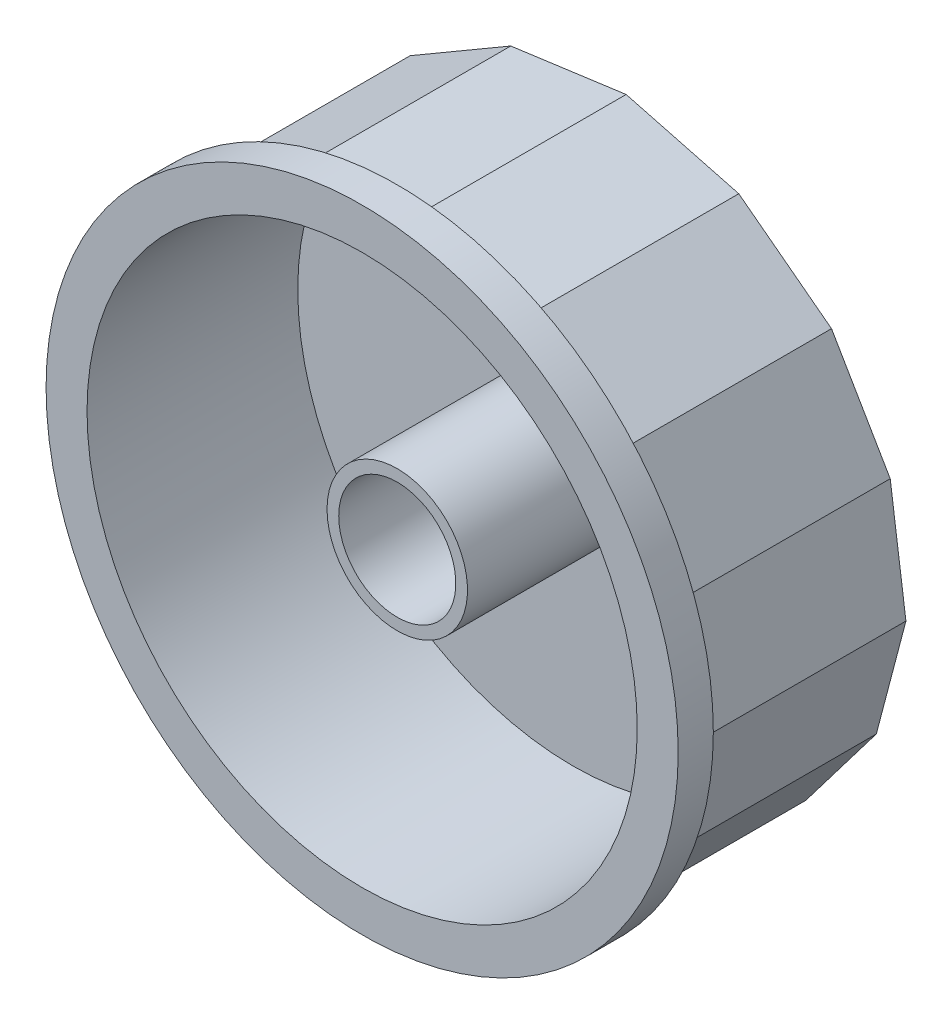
ISO-10303-21;
HEADER;
FILE_DESCRIPTION(('STEP AP214'),'2;1');
FILE_NAME('part.step','',(''),(''),'','','');
FILE_SCHEMA(('AUTOMOTIVE_DESIGN { 1 0 10303 214 1 1 1 1 }'));
ENDSEC;
DATA;
#1=APPLICATION_CONTEXT('core data for automotive mechanical design processes');
#2=APPLICATION_PROTOCOL_DEFINITION('international standard','automotive_design',2000,#1);
#3=PRODUCT_CONTEXT('',#1,'mechanical');
#4=PRODUCT('Part','Part','',(#3));
#5=PRODUCT_RELATED_PRODUCT_CATEGORY('part','',(#4));
#6=PRODUCT_DEFINITION_FORMATION('','',#4);
#7=PRODUCT_DEFINITION_CONTEXT('part definition',#1,'design');
#8=PRODUCT_DEFINITION('design','',#6,#7);
#9=PRODUCT_DEFINITION_SHAPE('','',#8);
#10=(LENGTH_UNIT() NAMED_UNIT(*) SI_UNIT(.MILLI.,.METRE.));
#11=(NAMED_UNIT(*) PLANE_ANGLE_UNIT() SI_UNIT($,.RADIAN.));
#12=(NAMED_UNIT(*) SI_UNIT($,.STERADIAN.) SOLID_ANGLE_UNIT());
#13=UNCERTAINTY_MEASURE_WITH_UNIT(LENGTH_MEASURE(1.E-05),#10,'distance_accuracy_value','');
#14=(GEOMETRIC_REPRESENTATION_CONTEXT(3) GLOBAL_UNCERTAINTY_ASSIGNED_CONTEXT((#13)) GLOBAL_UNIT_ASSIGNED_CONTEXT((#10,
#11,#12)) REPRESENTATION_CONTEXT('',''));
#15=CARTESIAN_POINT('',(0.,0.,0.));
#16=DIRECTION('',(0.,0.,1.));
#17=DIRECTION('',(1.,0.,0.));
#18=AXIS2_PLACEMENT_3D('',#15,#16,#17);
#19=CARTESIAN_POINT('',(0.,0.,0.));
#20=DIRECTION('',(0.,0.,1.));
#21=DIRECTION('',(1.,0.,0.));
#22=AXIS2_PLACEMENT_3D('',#19,#20,#21);
#23=PLANE('',#22);
#24=CARTESIAN_POINT('',(0.,0.,0.));
#25=DIRECTION('',(0.,0.,-1.));
#26=DIRECTION('',(-1.,0.,0.));
#27=AXIS2_PLACEMENT_3D('',#24,#25,#26);
#28=CIRCLE('',#27,11.);
#29=CARTESIAN_POINT('',(-11.,0.,0.));
#30=VERTEX_POINT('',#29);
#31=EDGE_CURVE('E287',#30,#30,#28,.T.);
#32=ORIENTED_EDGE('',*,*,#31,.F.);
#33=EDGE_LOOP('',(#32));
#34=FACE_BOUND('',#33,.T.);
#35=DIRECTION('',(0.13501757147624,-0.990843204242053,0.));
#36=VECTOR('',#35,1.);
#37=CARTESIAN_POINT('',(24.7810129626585,3.37679279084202,0.));
#38=LINE('',#37,#36);
#39=CARTESIAN_POINT('',(24.1093271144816,8.30604274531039,0.));
#40=VERTEX_POINT('',#39);
#41=CARTESIAN_POINT('',(25.4526988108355,-1.55245716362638,0.));
#42=VERTEX_POINT('',#41);
#43=EDGE_CURVE('E189',#40,#42,#38,.T.);
#44=ORIENTED_EDGE('',*,*,#43,.T.);
#45=DIRECTION('',(-0.254439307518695,-0.967088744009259,0.));
#46=VECTOR('',#45,1.);
#47=CARTESIAN_POINT('',(24.1869133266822,-6.36353335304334,0.));
#48=LINE('',#47,#46);
#49=CARTESIAN_POINT('',(22.9211278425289,-11.1746095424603,0.));
#50=VERTEX_POINT('',#49);
#51=EDGE_CURVE('E291',#42,#50,#48,.T.);
#52=ORIENTED_EDGE('',*,*,#51,.T.);
#53=DIRECTION('',(-0.605160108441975,-0.796103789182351,0.));
#54=VECTOR('',#53,1.);
#55=CARTESIAN_POINT('',(19.9105753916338,-15.1350692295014,0.));
#56=LINE('',#55,#54);
#57=CARTESIAN_POINT('',(16.9000229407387,-19.0955289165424,0.));
#58=VERTEX_POINT('',#57);
#59=EDGE_CURVE('E208',#50,#58,#56,.T.);
#60=ORIENTED_EDGE('',*,*,#59,.T.);
#61=DIRECTION('',(-0.863750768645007,-0.50391924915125,0.));
#62=VECTOR('',#61,1.);
#63=CARTESIAN_POINT('',(12.6030328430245,-21.602428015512,0.));
#64=LINE('',#63,#62);
#65=CARTESIAN_POINT('',(8.30604274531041,-24.1093271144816,0.));
#66=VERTEX_POINT('',#65);
#67=EDGE_CURVE('E308',#58,#66,#64,.T.);
#68=ORIENTED_EDGE('',*,*,#67,.T.);
#69=DIRECTION('',(-0.990843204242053,-0.13501757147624,0.));
#70=VECTOR('',#69,1.);
#71=CARTESIAN_POINT('',(3.37679279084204,-24.7810129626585,0.));
#72=LINE('',#71,#70);
#73=CARTESIAN_POINT('',(-1.55245716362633,-25.4526988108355,0.));
#74=VERTEX_POINT('',#73);
#75=EDGE_CURVE('E314',#66,#74,#72,.T.);
#76=ORIENTED_EDGE('',*,*,#75,.T.);
#77=DIRECTION('',(-0.967088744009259,0.254439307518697,0.));
#78=VECTOR('',#77,1.);
#79=CARTESIAN_POINT('',(-6.36353335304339,-24.1869133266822,0.));
#80=LINE('',#79,#78);
#81=CARTESIAN_POINT('',(-11.1746095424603,-22.9211278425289,0.));
#82=VERTEX_POINT('',#81);
#83=EDGE_CURVE('E255',#74,#82,#80,.T.);
#84=ORIENTED_EDGE('',*,*,#83,.T.);
#85=DIRECTION('',(-0.796103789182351,0.605160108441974,0.));
#86=VECTOR('',#85,1.);
#87=CARTESIAN_POINT('',(-15.1350692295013,-19.9105753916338,0.));
#88=LINE('',#87,#86);
#89=CARTESIAN_POINT('',(-19.0955289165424,-16.9000229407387,0.));
#90=VERTEX_POINT('',#89);
#91=EDGE_CURVE('E320',#82,#90,#88,.T.);
#92=ORIENTED_EDGE('',*,*,#91,.T.);
#93=DIRECTION('',(-0.50391924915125,0.863750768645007,0.));
#94=VECTOR('',#93,1.);
#95=CARTESIAN_POINT('',(-21.602428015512,-12.6030328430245,0.));
#96=LINE('',#95,#94);
#97=CARTESIAN_POINT('',(-24.1093271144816,-8.30604274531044,0.));
#98=VERTEX_POINT('',#97);
#99=EDGE_CURVE('E247',#90,#98,#96,.T.);
#100=ORIENTED_EDGE('',*,*,#99,.T.);
#101=DIRECTION('',(-0.135017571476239,0.990843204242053,0.));
#102=VECTOR('',#101,1.);
#103=CARTESIAN_POINT('',(-24.7810129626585,-3.376792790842,0.));
#104=LINE('',#103,#102);
#105=CARTESIAN_POINT('',(-25.4526988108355,1.55245716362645,0.));
#106=VERTEX_POINT('',#105);
#107=EDGE_CURVE('E332',#98,#106,#104,.T.);
#108=ORIENTED_EDGE('',*,*,#107,.T.);
#109=DIRECTION('',(0.254439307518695,0.967088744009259,0.));
#110=VECTOR('',#109,1.);
#111=CARTESIAN_POINT('',(-24.1869133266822,6.36353335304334,0.));
#112=LINE('',#111,#110);
#113=CARTESIAN_POINT('',(-22.9211278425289,11.1746095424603,0.));
#114=VERTEX_POINT('',#113);
#115=EDGE_CURVE('E239',#106,#114,#112,.T.);
#116=ORIENTED_EDGE('',*,*,#115,.T.);
#117=DIRECTION('',(0.605160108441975,0.796103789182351,0.));
#118=VECTOR('',#117,1.);
#119=CARTESIAN_POINT('',(-19.9105753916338,15.1350692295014,0.));
#120=LINE('',#119,#118);
#121=CARTESIAN_POINT('',(-16.9000229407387,19.0955289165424,0.));
#122=VERTEX_POINT('',#121);
#123=EDGE_CURVE('E340',#114,#122,#120,.T.);
#124=ORIENTED_EDGE('',*,*,#123,.T.);
#125=DIRECTION('',(0.863750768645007,0.50391924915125,0.));
#126=VECTOR('',#125,1.);
#127=CARTESIAN_POINT('',(-12.6030328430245,21.602428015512,0.));
#128=LINE('',#127,#126);
#129=CARTESIAN_POINT('',(-8.30604274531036,24.1093271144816,0.));
#130=VERTEX_POINT('',#129);
#131=EDGE_CURVE('E231',#122,#130,#128,.T.);
#132=ORIENTED_EDGE('',*,*,#131,.T.);
#133=DIRECTION('',(0.990843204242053,0.13501757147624,0.));
#134=VECTOR('',#133,1.);
#135=CARTESIAN_POINT('',(-3.37679279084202,24.7810129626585,0.));
#136=LINE('',#135,#134);
#137=CARTESIAN_POINT('',(1.5524571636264,25.4526988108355,0.));
#138=VERTEX_POINT('',#137);
#139=EDGE_CURVE('E348',#130,#138,#136,.T.);
#140=ORIENTED_EDGE('',*,*,#139,.T.);
#141=DIRECTION('',(0.967088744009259,-0.254439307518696,0.));
#142=VECTOR('',#141,1.);
#143=CARTESIAN_POINT('',(6.36353335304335,24.1869133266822,0.));
#144=LINE('',#143,#142);
#145=CARTESIAN_POINT('',(11.1746095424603,22.9211278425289,0.));
#146=VERTEX_POINT('',#145);
#147=EDGE_CURVE('E223',#138,#146,#144,.T.);
#148=ORIENTED_EDGE('',*,*,#147,.T.);
#149=DIRECTION('',(0.796103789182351,-0.605160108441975,0.));
#150=VECTOR('',#149,1.);
#151=CARTESIAN_POINT('',(15.1350692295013,19.9105753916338,0.));
#152=LINE('',#151,#150);
#153=CARTESIAN_POINT('',(19.0955289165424,16.9000229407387,0.));
#154=VERTEX_POINT('',#153);
#155=EDGE_CURVE('E356',#146,#154,#152,.T.);
#156=ORIENTED_EDGE('',*,*,#155,.T.);
#157=DIRECTION('',(0.50391924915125,-0.863750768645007,0.));
#158=VECTOR('',#157,1.);
#159=CARTESIAN_POINT('',(21.602428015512,12.6030328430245,0.));
#160=LINE('',#159,#158);
#161=EDGE_CURVE('E211',#154,#40,#160,.T.);
#162=ORIENTED_EDGE('',*,*,#161,.T.);
#163=EDGE_LOOP('',(#44,#52,#60,#68,#76,#84,#92,#100,#108,#116,#124,#132,#140,#148,#156,#162));
#164=FACE_BOUND('',#163,.T.);
#165=ADVANCED_FACE('F75',(#34,#164),#23,.F.);
#166=CARTESIAN_POINT('',(0.,0.,21.));
#167=DIRECTION('',(0.,0.,-1.));
#168=DIRECTION('',(-1.,0.,0.));
#169=AXIS2_PLACEMENT_3D('',#166,#167,#168);
#170=CYLINDRICAL_SURFACE('',#169,27.);
#171=CARTESIAN_POINT('',(0.,0.,21.));
#172=DIRECTION('',(0.,0.,1.));
#173=DIRECTION('',(1.,0.,0.));
#174=AXIS2_PLACEMENT_3D('',#171,#172,#173);
#175=CIRCLE('',#174,27.);
#176=CARTESIAN_POINT('',(27.,0.,21.));
#177=VERTEX_POINT('',#176);
#178=EDGE_CURVE('E83',#177,#177,#175,.T.);
#179=ORIENTED_EDGE('',*,*,#178,.F.);
#180=EDGE_LOOP('',(#179));
#181=FACE_BOUND('',#180,.T.);
#182=CARTESIAN_POINT('',(0.,0.,18.));
#183=DIRECTION('',(0.,0.,1.));
#184=DIRECTION('',(1.,0.,0.));
#185=AXIS2_PLACEMENT_3D('',#182,#183,#184);
#186=CIRCLE('',#185,27.);
#187=CARTESIAN_POINT('',(27.,0.,18.));
#188=VERTEX_POINT('',#187);
#189=EDGE_CURVE('E194',#188,#188,#186,.T.);
#190=ORIENTED_EDGE('',*,*,#189,.T.);
#191=EDGE_LOOP('',(#190));
#192=FACE_BOUND('',#191,.T.);
#193=ADVANCED_FACE('F264',(#181,#192),#170,.T.);
#194=CARTESIAN_POINT('',(0.,0.,21.));
#195=DIRECTION('',(0.,0.,1.));
#196=DIRECTION('',(1.,0.,0.));
#197=AXIS2_PLACEMENT_3D('',#194,#195,#196);
#198=PLANE('',#197);
#199=CARTESIAN_POINT('',(0.,0.,21.));
#200=DIRECTION('',(0.,0.,1.));
#201=DIRECTION('',(1.,0.,0.));
#202=AXIS2_PLACEMENT_3D('',#199,#200,#201);
#203=CIRCLE('',#202,23.5);
#204=CARTESIAN_POINT('',(23.5,0.,21.));
#205=VERTEX_POINT('',#204);
#206=EDGE_CURVE('E398',#205,#205,#203,.T.);
#207=ORIENTED_EDGE('',*,*,#206,.F.);
#208=EDGE_LOOP('',(#207));
#209=FACE_BOUND('',#208,.T.);
#210=ORIENTED_EDGE('',*,*,#178,.T.);
#211=EDGE_LOOP('',(#210));
#212=FACE_BOUND('',#211,.T.);
#213=ADVANCED_FACE('F267',(#209,#212),#198,.T.);
#214=CARTESIAN_POINT('',(0.,0.,18.));
#215=DIRECTION('',(0.,0.,1.));
#216=DIRECTION('',(1.,0.,0.));
#217=AXIS2_PLACEMENT_3D('',#214,#215,#216);
#218=PLANE('',#217);
#219=DIRECTION('',(-0.254439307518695,-0.967088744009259,0.));
#220=VECTOR('',#219,1.);
#221=CARTESIAN_POINT('',(24.1869133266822,-6.36353335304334,18.));
#222=LINE('',#221,#220);
#223=CARTESIAN_POINT('',(25.4526988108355,-1.55245716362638,18.));
#224=VERTEX_POINT('',#223);
#225=CARTESIAN_POINT('',(22.9211278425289,-11.1746095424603,18.));
#226=VERTEX_POINT('',#225);
#227=EDGE_CURVE('E206',#224,#226,#222,.T.);
#228=ORIENTED_EDGE('',*,*,#227,.F.);
#229=DIRECTION('',(0.13501757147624,-0.990843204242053,0.));
#230=VECTOR('',#229,1.);
#231=CARTESIAN_POINT('',(24.7810129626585,3.37679279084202,18.));
#232=LINE('',#231,#230);
#233=CARTESIAN_POINT('',(24.1093271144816,8.30604274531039,18.));
#234=VERTEX_POINT('',#233);
#235=EDGE_CURVE('E90',#234,#224,#232,.T.);
#236=ORIENTED_EDGE('',*,*,#235,.F.);
#237=DIRECTION('',(0.50391924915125,-0.863750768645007,0.));
#238=VECTOR('',#237,1.);
#239=CARTESIAN_POINT('',(21.602428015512,12.6030328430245,18.));
#240=LINE('',#239,#238);
#241=CARTESIAN_POINT('',(19.0955289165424,16.9000229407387,18.));
#242=VERTEX_POINT('',#241);
#243=EDGE_CURVE('E202',#242,#234,#240,.T.);
#244=ORIENTED_EDGE('',*,*,#243,.F.);
#245=DIRECTION('',(0.796103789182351,-0.605160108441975,0.));
#246=VECTOR('',#245,1.);
#247=CARTESIAN_POINT('',(15.1350692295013,19.9105753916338,18.));
#248=LINE('',#247,#246);
#249=CARTESIAN_POINT('',(11.1746095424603,22.9211278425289,18.));
#250=VERTEX_POINT('',#249);
#251=EDGE_CURVE('E304',#250,#242,#248,.T.);
#252=ORIENTED_EDGE('',*,*,#251,.F.);
#253=DIRECTION('',(0.967088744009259,-0.254439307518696,0.));
#254=VECTOR('',#253,1.);
#255=CARTESIAN_POINT('',(6.36353335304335,24.1869133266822,18.));
#256=LINE('',#255,#254);
#257=CARTESIAN_POINT('',(1.5524571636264,25.4526988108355,18.));
#258=VERTEX_POINT('',#257);
#259=EDGE_CURVE('E220',#258,#250,#256,.T.);
#260=ORIENTED_EDGE('',*,*,#259,.F.);
#261=DIRECTION('',(0.990843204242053,0.13501757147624,0.));
#262=VECTOR('',#261,1.);
#263=CARTESIAN_POINT('',(-3.37679279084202,24.7810129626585,18.));
#264=LINE('',#263,#262);
#265=CARTESIAN_POINT('',(-8.30604274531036,24.1093271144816,18.));
#266=VERTEX_POINT('',#265);
#267=EDGE_CURVE('E349',#266,#258,#264,.T.);
#268=ORIENTED_EDGE('',*,*,#267,.F.);
#269=DIRECTION('',(0.863750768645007,0.50391924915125,0.));
#270=VECTOR('',#269,1.);
#271=CARTESIAN_POINT('',(-12.6030328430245,21.602428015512,18.));
#272=LINE('',#271,#270);
#273=CARTESIAN_POINT('',(-16.9000229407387,19.0955289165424,18.));
#274=VERTEX_POINT('',#273);
#275=EDGE_CURVE('E228',#274,#266,#272,.T.);
#276=ORIENTED_EDGE('',*,*,#275,.F.);
#277=DIRECTION('',(0.605160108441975,0.796103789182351,0.));
#278=VECTOR('',#277,1.);
#279=CARTESIAN_POINT('',(-19.9105753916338,15.1350692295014,18.));
#280=LINE('',#279,#278);
#281=CARTESIAN_POINT('',(-22.9211278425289,11.1746095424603,18.));
#282=VERTEX_POINT('',#281);
#283=EDGE_CURVE('E341',#282,#274,#280,.T.);
#284=ORIENTED_EDGE('',*,*,#283,.F.);
#285=DIRECTION('',(0.254439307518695,0.967088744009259,0.));
#286=VECTOR('',#285,1.);
#287=CARTESIAN_POINT('',(-24.1869133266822,6.36353335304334,18.));
#288=LINE('',#287,#286);
#289=CARTESIAN_POINT('',(-25.4526988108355,1.55245716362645,18.));
#290=VERTEX_POINT('',#289);
#291=EDGE_CURVE('E236',#290,#282,#288,.T.);
#292=ORIENTED_EDGE('',*,*,#291,.F.);
#293=DIRECTION('',(-0.135017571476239,0.990843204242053,0.));
#294=VECTOR('',#293,1.);
#295=CARTESIAN_POINT('',(-24.7810129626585,-3.376792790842,18.));
#296=LINE('',#295,#294);
#297=CARTESIAN_POINT('',(-24.1093271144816,-8.30604274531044,18.));
#298=VERTEX_POINT('',#297);
#299=EDGE_CURVE('E333',#298,#290,#296,.T.);
#300=ORIENTED_EDGE('',*,*,#299,.F.);
#301=DIRECTION('',(-0.50391924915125,0.863750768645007,0.));
#302=VECTOR('',#301,1.);
#303=CARTESIAN_POINT('',(-21.602428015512,-12.6030328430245,18.));
#304=LINE('',#303,#302);
#305=CARTESIAN_POINT('',(-19.0955289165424,-16.9000229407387,18.));
#306=VERTEX_POINT('',#305);
#307=EDGE_CURVE('E244',#306,#298,#304,.T.);
#308=ORIENTED_EDGE('',*,*,#307,.F.);
#309=DIRECTION('',(-0.796103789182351,0.605160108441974,0.));
#310=VECTOR('',#309,1.);
#311=CARTESIAN_POINT('',(-15.1350692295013,-19.9105753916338,18.));
#312=LINE('',#311,#310);
#313=CARTESIAN_POINT('',(-11.1746095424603,-22.9211278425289,18.));
#314=VERTEX_POINT('',#313);
#315=EDGE_CURVE('E323',#314,#306,#312,.T.);
#316=ORIENTED_EDGE('',*,*,#315,.F.);
#317=DIRECTION('',(-0.967088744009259,0.254439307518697,0.));
#318=VECTOR('',#317,1.);
#319=CARTESIAN_POINT('',(-6.36353335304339,-24.1869133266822,18.));
#320=LINE('',#319,#318);
#321=CARTESIAN_POINT('',(-1.55245716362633,-25.4526988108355,18.));
#322=VERTEX_POINT('',#321);
#323=EDGE_CURVE('E252',#322,#314,#320,.T.);
#324=ORIENTED_EDGE('',*,*,#323,.F.);
#325=DIRECTION('',(-0.990843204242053,-0.13501757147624,0.));
#326=VECTOR('',#325,1.);
#327=CARTESIAN_POINT('',(3.37679279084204,-24.7810129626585,18.));
#328=LINE('',#327,#326);
#329=CARTESIAN_POINT('',(8.30604274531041,-24.1093271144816,18.));
#330=VERTEX_POINT('',#329);
#331=EDGE_CURVE('E98',#330,#322,#328,.T.);
#332=ORIENTED_EDGE('',*,*,#331,.F.);
#333=DIRECTION('',(-0.863750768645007,-0.50391924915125,0.));
#334=VECTOR('',#333,1.);
#335=CARTESIAN_POINT('',(12.6030328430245,-21.602428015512,18.));
#336=LINE('',#335,#334);
#337=CARTESIAN_POINT('',(16.9000229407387,-19.0955289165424,18.));
#338=VERTEX_POINT('',#337);
#339=EDGE_CURVE('E309',#338,#330,#336,.T.);
#340=ORIENTED_EDGE('',*,*,#339,.F.);
#341=DIRECTION('',(-0.605160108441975,-0.796103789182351,0.));
#342=VECTOR('',#341,1.);
#343=CARTESIAN_POINT('',(19.9105753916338,-15.1350692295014,18.));
#344=LINE('',#343,#342);
#345=EDGE_CURVE('E392',#226,#338,#344,.T.);
#346=ORIENTED_EDGE('',*,*,#345,.F.);
#347=EDGE_LOOP('',(#228,#236,#244,#252,#260,#268,#276,#284,#292,#300,#308,#316,#324,#332,#340,#346));
#348=FACE_BOUND('',#347,.T.);
#349=ORIENTED_EDGE('',*,*,#189,.F.);
#350=EDGE_LOOP('',(#349));
#351=FACE_BOUND('',#350,.T.);
#352=ADVANCED_FACE('F199',(#348,#351),#218,.F.);
#353=CARTESIAN_POINT('',(12.6030328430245,-21.602428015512,18.));
#354=DIRECTION('',(0.50391924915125,-0.863750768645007,0.));
#355=DIRECTION('',(0.863750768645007,0.50391924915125,0.));
#356=AXIS2_PLACEMENT_3D('',#353,#354,#355);
#357=PLANE('',#356);
#358=ORIENTED_EDGE('',*,*,#67,.F.);
#359=DIRECTION('',(0.,0.,-1.));
#360=VECTOR('',#359,1.);
#361=CARTESIAN_POINT('',(16.9000229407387,-19.0955289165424,18.));
#362=LINE('',#361,#360);
#363=EDGE_CURVE('E217',#338,#58,#362,.T.);
#364=ORIENTED_EDGE('',*,*,#363,.F.);
#365=ORIENTED_EDGE('',*,*,#339,.T.);
#366=DIRECTION('',(0.,0.,-1.));
#367=VECTOR('',#366,1.);
#368=CARTESIAN_POINT('',(8.30604274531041,-24.1093271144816,18.));
#369=LINE('',#368,#367);
#370=EDGE_CURVE('E318',#330,#66,#369,.T.);
#371=ORIENTED_EDGE('',*,*,#370,.T.);
#372=EDGE_LOOP('',(#358,#364,#365,#371));
#373=FACE_BOUND('',#372,.T.);
#374=ADVANCED_FACE('F266',(#373),#357,.T.);
#375=CARTESIAN_POINT('',(-6.36353335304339,-24.1869133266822,18.));
#376=DIRECTION('',(-0.254439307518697,-0.967088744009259,0.));
#377=DIRECTION('',(0.967088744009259,-0.254439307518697,0.));
#378=AXIS2_PLACEMENT_3D('',#375,#376,#377);
#379=PLANE('',#378);
#380=ORIENTED_EDGE('',*,*,#83,.F.);
#381=DIRECTION('',(0.,0.,-1.));
#382=VECTOR('',#381,1.);
#383=CARTESIAN_POINT('',(-1.55245716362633,-25.4526988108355,18.));
#384=LINE('',#383,#382);
#385=EDGE_CURVE('E250',#322,#74,#384,.T.);
#386=ORIENTED_EDGE('',*,*,#385,.F.);
#387=ORIENTED_EDGE('',*,*,#323,.T.);
#388=DIRECTION('',(0.,0.,-1.));
#389=VECTOR('',#388,1.);
#390=CARTESIAN_POINT('',(-11.1746095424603,-22.9211278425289,18.));
#391=LINE('',#390,#389);
#392=EDGE_CURVE('E328',#314,#82,#391,.T.);
#393=ORIENTED_EDGE('',*,*,#392,.T.);
#394=EDGE_LOOP('',(#380,#386,#387,#393));
#395=FACE_BOUND('',#394,.T.);
#396=ADVANCED_FACE('F273',(#395),#379,.T.);
#397=CARTESIAN_POINT('',(-21.602428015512,-12.6030328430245,18.));
#398=DIRECTION('',(-0.863750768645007,-0.50391924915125,0.));
#399=DIRECTION('',(0.50391924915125,-0.863750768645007,0.));
#400=AXIS2_PLACEMENT_3D('',#397,#398,#399);
#401=PLANE('',#400);
#402=ORIENTED_EDGE('',*,*,#99,.F.);
#403=DIRECTION('',(0.,0.,-1.));
#404=VECTOR('',#403,1.);
#405=CARTESIAN_POINT('',(-19.0955289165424,-16.9000229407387,18.));
#406=LINE('',#405,#404);
#407=EDGE_CURVE('E242',#306,#90,#406,.T.);
#408=ORIENTED_EDGE('',*,*,#407,.F.);
#409=ORIENTED_EDGE('',*,*,#307,.T.);
#410=DIRECTION('',(0.,0.,-1.));
#411=VECTOR('',#410,1.);
#412=CARTESIAN_POINT('',(-24.1093271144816,-8.30604274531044,18.));
#413=LINE('',#412,#411);
#414=EDGE_CURVE('E335',#298,#98,#413,.T.);
#415=ORIENTED_EDGE('',*,*,#414,.T.);
#416=EDGE_LOOP('',(#402,#408,#409,#415));
#417=FACE_BOUND('',#416,.T.);
#418=ADVANCED_FACE('F387',(#417),#401,.T.);
#419=CARTESIAN_POINT('',(-24.1869133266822,6.36353335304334,18.));
#420=DIRECTION('',(-0.967088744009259,0.254439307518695,0.));
#421=DIRECTION('',(-0.254439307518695,-0.967088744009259,0.));
#422=AXIS2_PLACEMENT_3D('',#419,#420,#421);
#423=PLANE('',#422);
#424=ORIENTED_EDGE('',*,*,#115,.F.);
#425=DIRECTION('',(0.,0.,-1.));
#426=VECTOR('',#425,1.);
#427=CARTESIAN_POINT('',(-25.4526988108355,1.55245716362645,18.));
#428=LINE('',#427,#426);
#429=EDGE_CURVE('E234',#290,#106,#428,.T.);
#430=ORIENTED_EDGE('',*,*,#429,.F.);
#431=ORIENTED_EDGE('',*,*,#291,.T.);
#432=DIRECTION('',(0.,0.,-1.));
#433=VECTOR('',#432,1.);
#434=CARTESIAN_POINT('',(-22.9211278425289,11.1746095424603,18.));
#435=LINE('',#434,#433);
#436=EDGE_CURVE('E343',#282,#114,#435,.T.);
#437=ORIENTED_EDGE('',*,*,#436,.T.);
#438=EDGE_LOOP('',(#424,#430,#431,#437));
#439=FACE_BOUND('',#438,.T.);
#440=ADVANCED_FACE('F378',(#439),#423,.T.);
#441=CARTESIAN_POINT('',(-12.6030328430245,21.602428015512,18.));
#442=DIRECTION('',(-0.50391924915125,0.863750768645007,0.));
#443=DIRECTION('',(-0.863750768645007,-0.50391924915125,0.));
#444=AXIS2_PLACEMENT_3D('',#441,#442,#443);
#445=PLANE('',#444);
#446=ORIENTED_EDGE('',*,*,#131,.F.);
#447=DIRECTION('',(0.,0.,-1.));
#448=VECTOR('',#447,1.);
#449=CARTESIAN_POINT('',(-16.9000229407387,19.0955289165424,18.));
#450=LINE('',#449,#448);
#451=EDGE_CURVE('E226',#274,#122,#450,.T.);
#452=ORIENTED_EDGE('',*,*,#451,.F.);
#453=ORIENTED_EDGE('',*,*,#275,.T.);
#454=DIRECTION('',(0.,0.,-1.));
#455=VECTOR('',#454,1.);
#456=CARTESIAN_POINT('',(-8.30604274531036,24.1093271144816,18.));
#457=LINE('',#456,#455);
#458=EDGE_CURVE('E351',#266,#130,#457,.T.);
#459=ORIENTED_EDGE('',*,*,#458,.T.);
#460=EDGE_LOOP('',(#446,#452,#453,#459));
#461=FACE_BOUND('',#460,.T.);
#462=ADVANCED_FACE('F372',(#461),#445,.T.);
#463=CARTESIAN_POINT('',(6.36353335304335,24.1869133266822,18.));
#464=DIRECTION('',(0.254439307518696,0.967088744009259,0.));
#465=DIRECTION('',(-0.967088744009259,0.254439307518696,0.));
#466=AXIS2_PLACEMENT_3D('',#463,#464,#465);
#467=PLANE('',#466);
#468=ORIENTED_EDGE('',*,*,#147,.F.);
#469=DIRECTION('',(0.,0.,-1.));
#470=VECTOR('',#469,1.);
#471=CARTESIAN_POINT('',(1.5524571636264,25.4526988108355,18.));
#472=LINE('',#471,#470);
#473=EDGE_CURVE('E214',#258,#138,#472,.T.);
#474=ORIENTED_EDGE('',*,*,#473,.F.);
#475=ORIENTED_EDGE('',*,*,#259,.T.);
#476=DIRECTION('',(0.,0.,-1.));
#477=VECTOR('',#476,1.);
#478=CARTESIAN_POINT('',(11.1746095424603,22.9211278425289,18.));
#479=LINE('',#478,#477);
#480=EDGE_CURVE('E300',#250,#146,#479,.T.);
#481=ORIENTED_EDGE('',*,*,#480,.T.);
#482=EDGE_LOOP('',(#468,#474,#475,#481));
#483=FACE_BOUND('',#482,.T.);
#484=ADVANCED_FACE('F362',(#483),#467,.T.);
#485=CARTESIAN_POINT('',(21.602428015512,12.6030328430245,18.));
#486=DIRECTION('',(0.863750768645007,0.50391924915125,0.));
#487=DIRECTION('',(-0.50391924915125,0.863750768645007,0.));
#488=AXIS2_PLACEMENT_3D('',#485,#486,#487);
#489=PLANE('',#488);
#490=ORIENTED_EDGE('',*,*,#161,.F.);
#491=DIRECTION('',(0.,0.,-1.));
#492=VECTOR('',#491,1.);
#493=CARTESIAN_POINT('',(19.0955289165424,16.9000229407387,18.));
#494=LINE('',#493,#492);
#495=EDGE_CURVE('E195',#242,#154,#494,.T.);
#496=ORIENTED_EDGE('',*,*,#495,.F.);
#497=ORIENTED_EDGE('',*,*,#243,.T.);
#498=DIRECTION('',(0.,0.,-1.));
#499=VECTOR('',#498,1.);
#500=CARTESIAN_POINT('',(24.1093271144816,8.30604274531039,18.));
#501=LINE('',#500,#499);
#502=EDGE_CURVE('E186',#234,#40,#501,.T.);
#503=ORIENTED_EDGE('',*,*,#502,.T.);
#504=EDGE_LOOP('',(#490,#496,#497,#503));
#505=FACE_BOUND('',#504,.T.);
#506=ADVANCED_FACE('F210',(#505),#489,.T.);
#507=CARTESIAN_POINT('',(24.1869133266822,-6.36353335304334,18.));
#508=DIRECTION('',(0.967088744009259,-0.254439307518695,0.));
#509=DIRECTION('',(0.254439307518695,0.96708874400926,0.));
#510=AXIS2_PLACEMENT_3D('',#507,#508,#509);
#511=PLANE('',#510);
#512=ORIENTED_EDGE('',*,*,#51,.F.);
#513=DIRECTION('',(0.,0.,-1.));
#514=VECTOR('',#513,1.);
#515=CARTESIAN_POINT('',(25.4526988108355,-1.55245716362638,18.));
#516=LINE('',#515,#514);
#517=EDGE_CURVE('E298',#224,#42,#516,.T.);
#518=ORIENTED_EDGE('',*,*,#517,.F.);
#519=ORIENTED_EDGE('',*,*,#227,.T.);
#520=DIRECTION('',(0.,0.,-1.));
#521=VECTOR('',#520,1.);
#522=CARTESIAN_POINT('',(22.9211278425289,-11.1746095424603,18.));
#523=LINE('',#522,#521);
#524=EDGE_CURVE('E299',#226,#50,#523,.T.);
#525=ORIENTED_EDGE('',*,*,#524,.T.);
#526=EDGE_LOOP('',(#512,#518,#519,#525));
#527=FACE_BOUND('',#526,.T.);
#528=ADVANCED_FACE('F297',(#527),#511,.T.);
#529=CARTESIAN_POINT('',(15.1350692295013,19.9105753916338,18.));
#530=DIRECTION('',(0.605160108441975,0.796103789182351,0.));
#531=DIRECTION('',(-0.796103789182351,0.605160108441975,0.));
#532=AXIS2_PLACEMENT_3D('',#529,#530,#531);
#533=PLANE('',#532);
#534=ORIENTED_EDGE('',*,*,#155,.F.);
#535=ORIENTED_EDGE('',*,*,#480,.F.);
#536=ORIENTED_EDGE('',*,*,#251,.T.);
#537=ORIENTED_EDGE('',*,*,#495,.T.);
#538=EDGE_LOOP('',(#534,#535,#536,#537));
#539=FACE_BOUND('',#538,.T.);
#540=ADVANCED_FACE('F360',(#539),#533,.T.);
#541=CARTESIAN_POINT('',(-3.37679279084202,24.7810129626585,18.));
#542=DIRECTION('',(-0.13501757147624,0.990843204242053,0.));
#543=DIRECTION('',(-0.990843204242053,-0.13501757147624,0.));
#544=AXIS2_PLACEMENT_3D('',#541,#542,#543);
#545=PLANE('',#544);
#546=ORIENTED_EDGE('',*,*,#139,.F.);
#547=ORIENTED_EDGE('',*,*,#458,.F.);
#548=ORIENTED_EDGE('',*,*,#267,.T.);
#549=ORIENTED_EDGE('',*,*,#473,.T.);
#550=EDGE_LOOP('',(#546,#547,#548,#549));
#551=FACE_BOUND('',#550,.T.);
#552=ADVANCED_FACE('F474',(#551),#545,.T.);
#553=CARTESIAN_POINT('',(-19.9105753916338,15.1350692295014,18.));
#554=DIRECTION('',(-0.796103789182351,0.605160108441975,0.));
#555=DIRECTION('',(-0.605160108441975,-0.796103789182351,0.));
#556=AXIS2_PLACEMENT_3D('',#553,#554,#555);
#557=PLANE('',#556);
#558=ORIENTED_EDGE('',*,*,#123,.F.);
#559=ORIENTED_EDGE('',*,*,#436,.F.);
#560=ORIENTED_EDGE('',*,*,#283,.T.);
#561=ORIENTED_EDGE('',*,*,#451,.T.);
#562=EDGE_LOOP('',(#558,#559,#560,#561));
#563=FACE_BOUND('',#562,.T.);
#564=ADVANCED_FACE('F374',(#563),#557,.T.);
#565=CARTESIAN_POINT('',(-24.7810129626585,-3.376792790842,18.));
#566=DIRECTION('',(-0.990843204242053,-0.135017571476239,0.));
#567=DIRECTION('',(0.135017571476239,-0.990843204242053,0.));
#568=AXIS2_PLACEMENT_3D('',#565,#566,#567);
#569=PLANE('',#568);
#570=ORIENTED_EDGE('',*,*,#107,.F.);
#571=ORIENTED_EDGE('',*,*,#414,.F.);
#572=ORIENTED_EDGE('',*,*,#299,.T.);
#573=ORIENTED_EDGE('',*,*,#429,.T.);
#574=EDGE_LOOP('',(#570,#571,#572,#573));
#575=FACE_BOUND('',#574,.T.);
#576=ADVANCED_FACE('F469',(#575),#569,.T.);
#577=CARTESIAN_POINT('',(-15.1350692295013,-19.9105753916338,18.));
#578=DIRECTION('',(-0.605160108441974,-0.796103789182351,0.));
#579=DIRECTION('',(0.796103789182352,-0.605160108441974,0.));
#580=AXIS2_PLACEMENT_3D('',#577,#578,#579);
#581=PLANE('',#580);
#582=ORIENTED_EDGE('',*,*,#91,.F.);
#583=ORIENTED_EDGE('',*,*,#392,.F.);
#584=ORIENTED_EDGE('',*,*,#315,.T.);
#585=ORIENTED_EDGE('',*,*,#407,.T.);
#586=EDGE_LOOP('',(#582,#583,#584,#585));
#587=FACE_BOUND('',#586,.T.);
#588=ADVANCED_FACE('F389',(#587),#581,.T.);
#589=CARTESIAN_POINT('',(3.37679279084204,-24.7810129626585,18.));
#590=DIRECTION('',(0.13501757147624,-0.990843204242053,0.));
#591=DIRECTION('',(0.990843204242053,0.13501757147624,0.));
#592=AXIS2_PLACEMENT_3D('',#589,#590,#591);
#593=PLANE('',#592);
#594=ORIENTED_EDGE('',*,*,#75,.F.);
#595=ORIENTED_EDGE('',*,*,#370,.F.);
#596=ORIENTED_EDGE('',*,*,#331,.T.);
#597=ORIENTED_EDGE('',*,*,#385,.T.);
#598=EDGE_LOOP('',(#594,#595,#596,#597));
#599=FACE_BOUND('',#598,.T.);
#600=ADVANCED_FACE('F464',(#599),#593,.T.);
#601=CARTESIAN_POINT('',(19.9105753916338,-15.1350692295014,18.));
#602=DIRECTION('',(0.796103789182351,-0.605160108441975,0.));
#603=DIRECTION('',(0.605160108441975,0.796103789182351,0.));
#604=AXIS2_PLACEMENT_3D('',#601,#602,#603);
#605=PLANE('',#604);
#606=ORIENTED_EDGE('',*,*,#59,.F.);
#607=ORIENTED_EDGE('',*,*,#524,.F.);
#608=ORIENTED_EDGE('',*,*,#345,.T.);
#609=ORIENTED_EDGE('',*,*,#363,.T.);
#610=EDGE_LOOP('',(#606,#607,#608,#609));
#611=FACE_BOUND('',#610,.T.);
#612=ADVANCED_FACE('F461',(#611),#605,.T.);
#613=CARTESIAN_POINT('',(24.7810129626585,3.37679279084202,18.));
#614=DIRECTION('',(0.990843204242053,0.13501757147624,0.));
#615=DIRECTION('',(-0.13501757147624,0.990843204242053,0.));
#616=AXIS2_PLACEMENT_3D('',#613,#614,#615);
#617=PLANE('',#616);
#618=ORIENTED_EDGE('',*,*,#43,.F.);
#619=ORIENTED_EDGE('',*,*,#502,.F.);
#620=ORIENTED_EDGE('',*,*,#235,.T.);
#621=ORIENTED_EDGE('',*,*,#517,.T.);
#622=EDGE_LOOP('',(#618,#619,#620,#621));
#623=FACE_BOUND('',#622,.T.);
#624=ADVANCED_FACE('F187',(#623),#617,.T.);
#625=CARTESIAN_POINT('',(0.,0.,3.));
#626=DIRECTION('',(0.,0.,1.));
#627=DIRECTION('',(1.,0.,0.));
#628=AXIS2_PLACEMENT_3D('',#625,#626,#627);
#629=CYLINDRICAL_SURFACE('',#628,23.5);
#630=CARTESIAN_POINT('',(0.,0.,3.));
#631=DIRECTION('',(0.,0.,1.));
#632=DIRECTION('',(1.,0.,0.));
#633=AXIS2_PLACEMENT_3D('',#630,#631,#632);
#634=CIRCLE('',#633,23.5);
#635=CARTESIAN_POINT('',(23.5,0.,3.));
#636=VERTEX_POINT('',#635);
#637=EDGE_CURVE('E293',#636,#636,#634,.T.);
#638=ORIENTED_EDGE('',*,*,#637,.F.);
#639=EDGE_LOOP('',(#638));
#640=FACE_BOUND('',#639,.T.);
#641=ORIENTED_EDGE('',*,*,#206,.T.);
#642=EDGE_LOOP('',(#641));
#643=FACE_BOUND('',#642,.T.);
#644=ADVANCED_FACE('F454',(#640,#643),#629,.F.);
#645=CARTESIAN_POINT('',(0.,0.,3.));
#646=DIRECTION('',(0.,0.,1.));
#647=DIRECTION('',(1.,0.,0.));
#648=AXIS2_PLACEMENT_3D('',#645,#646,#647);
#649=PLANE('',#648);
#650=CARTESIAN_POINT('',(0.,0.,3.));
#651=DIRECTION('',(0.,0.,1.));
#652=DIRECTION('',(1.,0.,0.));
#653=AXIS2_PLACEMENT_3D('',#650,#651,#652);
#654=CIRCLE('',#653,6.);
#655=CARTESIAN_POINT('',(6.,0.,3.));
#656=VERTEX_POINT('',#655);
#657=EDGE_CURVE('E12',#656,#656,#654,.T.);
#658=ORIENTED_EDGE('',*,*,#657,.F.);
#659=EDGE_LOOP('',(#658));
#660=FACE_BOUND('',#659,.T.);
#661=ORIENTED_EDGE('',*,*,#637,.T.);
#662=EDGE_LOOP('',(#661));
#663=FACE_BOUND('',#662,.T.);
#664=ADVANCED_FACE('F447',(#660,#663),#649,.T.);
#665=CARTESIAN_POINT('',(0.,0.,18.));
#666=DIRECTION('',(0.,0.,-1.));
#667=DIRECTION('',(-1.,0.,0.));
#668=AXIS2_PLACEMENT_3D('',#665,#666,#667);
#669=PLANE('',#668);
#670=CARTESIAN_POINT('',(0.,0.,18.));
#671=DIRECTION('',(0.,0.,-1.));
#672=DIRECTION('',(-1.,0.,0.));
#673=AXIS2_PLACEMENT_3D('',#670,#671,#672);
#674=CIRCLE('',#673,5.);
#675=CARTESIAN_POINT('',(-5.,0.,18.));
#676=VERTEX_POINT('',#675);
#677=EDGE_CURVE('E409',#676,#676,#674,.T.);
#678=ORIENTED_EDGE('',*,*,#677,.T.);
#679=EDGE_LOOP('',(#678));
#680=FACE_BOUND('',#679,.T.);
#681=CARTESIAN_POINT('',(0.,0.,18.));
#682=DIRECTION('',(0.,0.,-1.));
#683=DIRECTION('',(-1.,0.,0.));
#684=AXIS2_PLACEMENT_3D('',#681,#682,#683);
#685=CIRCLE('',#684,6.);
#686=CARTESIAN_POINT('',(-6.,0.,18.));
#687=VERTEX_POINT('',#686);
#688=EDGE_CURVE('E401',#687,#687,#685,.T.);
#689=ORIENTED_EDGE('',*,*,#688,.F.);
#690=EDGE_LOOP('',(#689));
#691=FACE_BOUND('',#690,.T.);
#692=ADVANCED_FACE('F443',(#680,#691),#669,.F.);
#693=CARTESIAN_POINT('',(0.,0.,18.));
#694=DIRECTION('',(0.,0.,-1.));
#695=DIRECTION('',(-1.,0.,0.));
#696=AXIS2_PLACEMENT_3D('',#693,#694,#695);
#697=CYLINDRICAL_SURFACE('',#696,6.);
#698=ORIENTED_EDGE('',*,*,#657,.T.);
#699=EDGE_LOOP('',(#698));
#700=FACE_BOUND('',#699,.T.);
#701=ORIENTED_EDGE('',*,*,#688,.T.);
#702=EDGE_LOOP('',(#701));
#703=FACE_BOUND('',#702,.T.);
#704=ADVANCED_FACE('F446',(#700,#703),#697,.T.);
#705=CARTESIAN_POINT('',(0.,0.,-12.));
#706=DIRECTION('',(0.,0.,-1.));
#707=DIRECTION('',(-1.,0.,0.));
#708=AXIS2_PLACEMENT_3D('',#705,#706,#707);
#709=CIRCLE('',#708,6.);
#710=CARTESIAN_POINT('',(-6.,0.,-12.));
#711=VERTEX_POINT('',#710);
#712=EDGE_CURVE('E406',#711,#711,#709,.T.);
#713=ORIENTED_EDGE('',*,*,#712,.F.);
#714=EDGE_LOOP('',(#713));
#715=FACE_BOUND('',#714,.T.);
#716=CARTESIAN_POINT('',(0.,0.,1.));
#717=DIRECTION('',(0.,0.,-1.));
#718=DIRECTION('',(-1.,0.,0.));
#719=AXIS2_PLACEMENT_3D('',#716,#717,#718);
#720=CIRCLE('',#719,6.);
#721=CARTESIAN_POINT('',(-6.,0.,1.));
#722=VERTEX_POINT('',#721);
#723=EDGE_CURVE('E414',#722,#722,#720,.T.);
#724=ORIENTED_EDGE('',*,*,#723,.T.);
#725=EDGE_LOOP('',(#724));
#726=FACE_BOUND('',#725,.T.);
#727=ADVANCED_FACE('F420',(#715,#726),#697,.T.);
#728=CARTESIAN_POINT('',(0.,0.,-12.));
#729=DIRECTION('',(0.,0.,-1.));
#730=DIRECTION('',(-1.,0.,0.));
#731=AXIS2_PLACEMENT_3D('',#728,#729,#730);
#732=PLANE('',#731);
#733=CARTESIAN_POINT('',(0.,0.,-12.));
#734=DIRECTION('',(0.,0.,-1.));
#735=DIRECTION('',(-1.,0.,0.));
#736=AXIS2_PLACEMENT_3D('',#733,#734,#735);
#737=CIRCLE('',#736,5.);
#738=CARTESIAN_POINT('',(-5.,0.,-12.));
#739=VERTEX_POINT('',#738);
#740=EDGE_CURVE('E78',#739,#739,#737,.T.);
#741=ORIENTED_EDGE('',*,*,#740,.F.);
#742=EDGE_LOOP('',(#741));
#743=FACE_BOUND('',#742,.T.);
#744=ORIENTED_EDGE('',*,*,#712,.T.);
#745=EDGE_LOOP('',(#744));
#746=FACE_BOUND('',#745,.T.);
#747=ADVANCED_FACE('F436',(#743,#746),#732,.T.);
#748=CARTESIAN_POINT('',(0.,0.,21.));
#749=DIRECTION('',(0.,0.,-1.));
#750=DIRECTION('',(-1.,0.,0.));
#751=AXIS2_PLACEMENT_3D('',#748,#749,#750);
#752=CYLINDRICAL_SURFACE('',#751,5.);
#753=ORIENTED_EDGE('',*,*,#740,.T.);
#754=EDGE_LOOP('',(#753));
#755=FACE_BOUND('',#754,.T.);
#756=ORIENTED_EDGE('',*,*,#677,.F.);
#757=EDGE_LOOP('',(#756));
#758=FACE_BOUND('',#757,.T.);
#759=ADVANCED_FACE('F431',(#755,#758),#752,.F.);
#760=CARTESIAN_POINT('',(0.,0.,1.));
#761=DIRECTION('',(0.,0.,-1.));
#762=DIRECTION('',(-1.,0.,0.));
#763=AXIS2_PLACEMENT_3D('',#760,#761,#762);
#764=CYLINDRICAL_SURFACE('',#763,11.);
#765=CARTESIAN_POINT('',(0.,0.,1.));
#766=DIRECTION('',(0.,0.,-1.));
#767=DIRECTION('',(-1.,0.,0.));
#768=AXIS2_PLACEMENT_3D('',#765,#766,#767);
#769=CIRCLE('',#768,11.);
#770=CARTESIAN_POINT('',(-11.,0.,1.));
#771=VERTEX_POINT('',#770);
#772=EDGE_CURVE('E413',#771,#771,#769,.T.);
#773=ORIENTED_EDGE('',*,*,#772,.F.);
#774=EDGE_LOOP('',(#773));
#775=FACE_BOUND('',#774,.T.);
#776=ORIENTED_EDGE('',*,*,#31,.T.);
#777=EDGE_LOOP('',(#776));
#778=FACE_BOUND('',#777,.T.);
#779=ADVANCED_FACE('F425',(#775,#778),#764,.F.);
#780=CARTESIAN_POINT('',(0.,0.,1.));
#781=DIRECTION('',(0.,0.,-1.));
#782=DIRECTION('',(-1.,0.,0.));
#783=AXIS2_PLACEMENT_3D('',#780,#781,#782);
#784=PLANE('',#783);
#785=ORIENTED_EDGE('',*,*,#723,.F.);
#786=EDGE_LOOP('',(#785));
#787=FACE_BOUND('',#786,.T.);
#788=ORIENTED_EDGE('',*,*,#772,.T.);
#789=EDGE_LOOP('',(#788));
#790=FACE_BOUND('',#789,.T.);
#791=ADVANCED_FACE('F422',(#787,#790),#784,.T.);
#792=CLOSED_SHELL('',(#165,#193,#213,#352,#374,#396,#418,#440,#462,#484,#506,#528,#540,#552,
#564,#576,#588,#600,#612,#624,#644,#664,#692,#704,#727,#747,#759,#779,#791));
#793=MANIFOLD_SOLID_BREP('B2',#792);
#794=ADVANCED_BREP_SHAPE_REPRESENTATION('',(#18,#793),#14);
#795=SHAPE_DEFINITION_REPRESENTATION(#9,#794);
ENDSEC;
END-ISO-10303-21;
